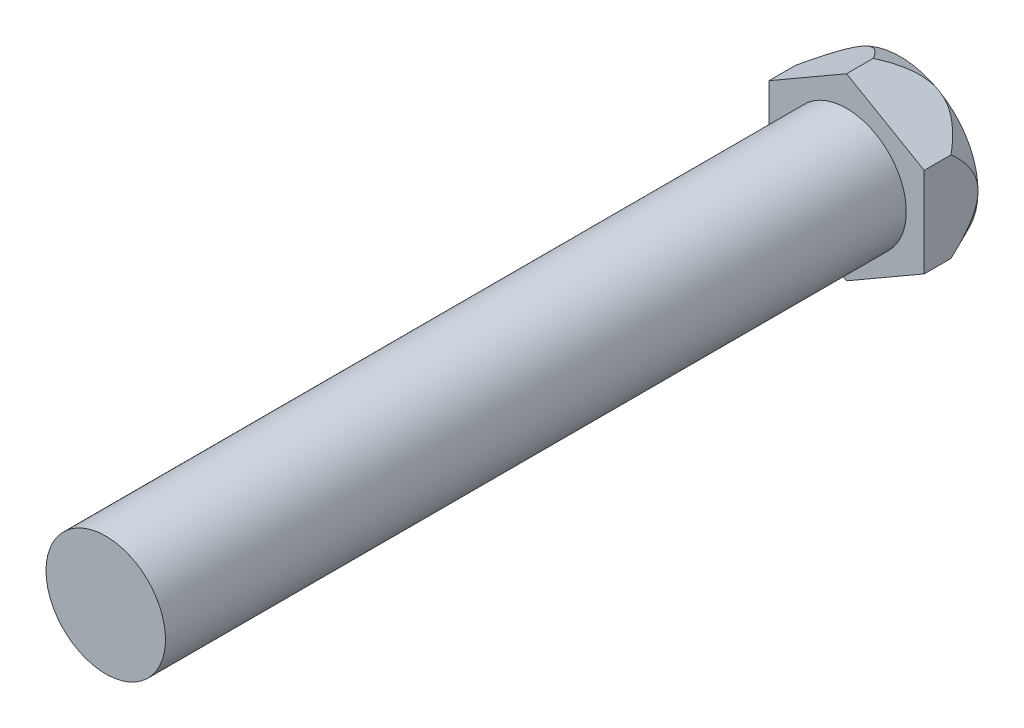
ISO-10303-21;
HEADER;
FILE_DESCRIPTION(('STEP AP214'),'2;1');
FILE_NAME('part.step','',(''),(''),'','','');
FILE_SCHEMA(('AUTOMOTIVE_DESIGN { 1 0 10303 214 1 1 1 1 }'));
ENDSEC;
DATA;
#1=APPLICATION_CONTEXT('core data for automotive mechanical design processes');
#2=APPLICATION_PROTOCOL_DEFINITION('international standard','automotive_design',2000,#1);
#3=PRODUCT_CONTEXT('',#1,'mechanical');
#4=PRODUCT('Part','Part','',(#3));
#5=PRODUCT_RELATED_PRODUCT_CATEGORY('part','',(#4));
#6=PRODUCT_DEFINITION_FORMATION('','',#4);
#7=PRODUCT_DEFINITION_CONTEXT('part definition',#1,'design');
#8=PRODUCT_DEFINITION('design','',#6,#7);
#9=PRODUCT_DEFINITION_SHAPE('','',#8);
#10=(LENGTH_UNIT() NAMED_UNIT(*) SI_UNIT(.MILLI.,.METRE.));
#11=(NAMED_UNIT(*) PLANE_ANGLE_UNIT() SI_UNIT($,.RADIAN.));
#12=(NAMED_UNIT(*) SI_UNIT($,.STERADIAN.) SOLID_ANGLE_UNIT());
#13=UNCERTAINTY_MEASURE_WITH_UNIT(LENGTH_MEASURE(1.E-05),#10,'distance_accuracy_value','');
#14=(GEOMETRIC_REPRESENTATION_CONTEXT(3) GLOBAL_UNCERTAINTY_ASSIGNED_CONTEXT((#13)) GLOBAL_UNIT_ASSIGNED_CONTEXT((#10,
#11,#12)) REPRESENTATION_CONTEXT('',''));
#15=CARTESIAN_POINT('',(0.,0.,0.));
#16=DIRECTION('',(0.,0.,1.));
#17=DIRECTION('',(1.,0.,0.));
#18=AXIS2_PLACEMENT_3D('',#15,#16,#17);
#19=CARTESIAN_POINT('',(0.,3.00222139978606,1.8));
#20=DIRECTION('',(0.,0.,1.));
#21=DIRECTION('',(1.,0.,0.));
#22=AXIS2_PLACEMENT_3D('',#19,#20,#21);
#23=PLANE('',#22);
#24=DIRECTION('',(-0.866025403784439,0.5,0.));
#25=VECTOR('',#24,1.);
#26=CARTESIAN_POINT('',(2.59999999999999,1.50111069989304,1.8));
#27=LINE('',#26,#25);
#28=CARTESIAN_POINT('',(2.59999999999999,1.50111069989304,1.8));
#29=VERTEX_POINT('',#28);
#30=CARTESIAN_POINT('',(0.,3.00222139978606,1.8));
#31=VERTEX_POINT('',#30);
#32=EDGE_CURVE('E233',#29,#31,#27,.T.);
#33=ORIENTED_EDGE('',*,*,#32,.T.);
#34=DIRECTION('',(-0.866025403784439,-0.499999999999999,0.));
#35=VECTOR('',#34,1.);
#36=CARTESIAN_POINT('',(0.,3.00222139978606,1.8));
#37=LINE('',#36,#35);
#38=CARTESIAN_POINT('',(-2.6,1.50111069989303,1.8));
#39=VERTEX_POINT('',#38);
#40=EDGE_CURVE('E232',#31,#39,#37,.T.);
#41=ORIENTED_EDGE('',*,*,#40,.T.);
#42=DIRECTION('',(0.,-1.,0.));
#43=VECTOR('',#42,1.);
#44=CARTESIAN_POINT('',(-2.6,1.50111069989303,1.8));
#45=LINE('',#44,#43);
#46=CARTESIAN_POINT('',(-2.60000000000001,-1.50111069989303,1.8));
#47=VERTEX_POINT('',#46);
#48=EDGE_CURVE('E228',#39,#47,#45,.T.);
#49=ORIENTED_EDGE('',*,*,#48,.T.);
#50=DIRECTION('',(0.866025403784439,-0.5,0.));
#51=VECTOR('',#50,1.);
#52=CARTESIAN_POINT('',(-2.60000000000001,-1.50111069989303,1.8));
#53=LINE('',#52,#51);
#54=CARTESIAN_POINT('',(0.,-3.00222139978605,1.8));
#55=VERTEX_POINT('',#54);
#56=EDGE_CURVE('E226',#47,#55,#53,.T.);
#57=ORIENTED_EDGE('',*,*,#56,.T.);
#58=DIRECTION('',(0.866025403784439,0.499999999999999,0.));
#59=VECTOR('',#58,1.);
#60=CARTESIAN_POINT('',(0.,-3.00222139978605,1.8));
#61=LINE('',#60,#59);
#62=CARTESIAN_POINT('',(2.59999999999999,-1.50111069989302,1.8));
#63=VERTEX_POINT('',#62);
#64=EDGE_CURVE('E224',#55,#63,#61,.T.);
#65=ORIENTED_EDGE('',*,*,#64,.T.);
#66=DIRECTION('',(0.,1.,0.));
#67=VECTOR('',#66,1.);
#68=CARTESIAN_POINT('',(2.59999999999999,-1.50111069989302,1.8));
#69=LINE('',#68,#67);
#70=EDGE_CURVE('E132',#63,#29,#69,.T.);
#71=ORIENTED_EDGE('',*,*,#70,.T.);
#72=EDGE_LOOP('',(#33,#41,#49,#57,#65,#71));
#73=FACE_BOUND('',#72,.T.);
#74=CARTESIAN_POINT('',(0.,0.,1.8));
#75=DIRECTION('',(0.,0.,1.));
#76=DIRECTION('',(1.,0.,0.));
#77=AXIS2_PLACEMENT_3D('',#74,#75,#76);
#78=CIRCLE('',#77,2.);
#79=CARTESIAN_POINT('',(-2.,0.,1.8));
#80=VERTEX_POINT('',#79);
#81=EDGE_CURVE('E246',#80,#80,#78,.T.);
#82=ORIENTED_EDGE('',*,*,#81,.F.);
#83=EDGE_LOOP('',(#82));
#84=FACE_BOUND('',#83,.T.);
#85=ADVANCED_FACE('F33',(#73,#84),#23,.T.);
#86=CARTESIAN_POINT('',(2.59999999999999,1.50111069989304,1.8));
#87=DIRECTION('',(-0.5,-0.866025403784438,0.));
#88=DIRECTION('',(0.866025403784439,-0.5,0.));
#89=AXIS2_PLACEMENT_3D('',#86,#87,#88);
#90=PLANE('',#89);
#91=CARTESIAN_POINT('',(-0.000199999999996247,3.0023368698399,0.903663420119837));
#92=CARTESIAN_POINT('',(0.0505418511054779,2.97304104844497,0.837965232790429));
#93=CARTESIAN_POINT('',(0.102480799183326,2.9430540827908,0.773392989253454));
#94=CARTESIAN_POINT('',(0.20979729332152,2.88109487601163,0.647258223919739));
#95=CARTESIAN_POINT('',(0.265197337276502,2.8491096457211,0.585721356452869));
#96=CARTESIAN_POINT('',(0.38178307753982,2.7817988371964,0.46532206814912));
#97=CARTESIAN_POINT('',(0.443104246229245,2.74639504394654,0.406631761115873));
#98=CARTESIAN_POINT('',(0.570477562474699,2.67285602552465,0.296879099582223));
#99=CARTESIAN_POINT('',(0.636513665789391,2.63473006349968,0.245792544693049));
#100=CARTESIAN_POINT('',(0.762562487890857,2.56195574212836,0.162330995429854));
#101=CARTESIAN_POINT('',(0.821712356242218,2.52780554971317,0.128253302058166));
#102=CARTESIAN_POINT('',(0.943392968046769,2.45755321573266,0.0707685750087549));
#103=CARTESIAN_POINT('',(1.00589571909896,2.42146723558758,0.0472850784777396));
#104=CARTESIAN_POINT('',(1.1345987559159,2.3471605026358,0.0133574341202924));
#105=CARTESIAN_POINT('',(1.20084027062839,2.30891594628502,0.00311287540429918));
#106=CARTESIAN_POINT('',(1.3338194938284,2.23214035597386,-0.00188356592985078));
#107=CARTESIAN_POINT('',(1.40055742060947,2.19360919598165,0.00337182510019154));
#108=CARTESIAN_POINT('',(1.52296787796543,2.12293548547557,0.0267089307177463));
#109=CARTESIAN_POINT('',(1.57891776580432,2.09063280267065,0.0429629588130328));
#110=CARTESIAN_POINT('',(1.68821868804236,2.02752788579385,0.0845012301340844));
#111=CARTESIAN_POINT('',(1.74156775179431,1.99672678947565,0.109792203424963));
#112=CARTESIAN_POINT('',(1.88849955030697,1.91189567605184,0.191333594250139));
#113=CARTESIAN_POINT('',(1.97860092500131,1.85987562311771,0.25582922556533));
#114=CARTESIAN_POINT('',(2.15021439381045,1.76079454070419,0.398848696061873));
#115=CARTESIAN_POINT('',(2.2316779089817,1.71376155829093,0.477445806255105));
#116=CARTESIAN_POINT('',(2.36101503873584,1.63908873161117,0.614723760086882));
#117=CARTESIAN_POINT('',(2.4108386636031,1.61032304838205,0.671008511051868));
#118=CARTESIAN_POINT('',(2.50748638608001,1.55452345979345,0.785780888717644));
#119=CARTESIAN_POINT('',(2.55433644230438,1.52747456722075,0.844239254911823));
#120=CARTESIAN_POINT('',(2.60019999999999,1.5009952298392,0.903663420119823));
#121=B_SPLINE_CURVE_WITH_KNOTS('',3,(#91,#92,#93,#94,#95,#96,#97,#98,#99,#100,#101,#102,#103,
#104,#105,#106,#107,#108,#109,#110,#111,#112,#113,#114,#115,#116,#117,#118,#119,#120),
.UNSPECIFIED.,.F.,.F.,(4,2,2,2,2,2,2,2,2,2,2,2,2,2,4),(0.,0.264191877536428,0.530328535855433,
0.80589864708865,1.08057203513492,1.30891430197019,1.53558107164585,1.76562664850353,
1.9957801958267,2.19485730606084,2.39408298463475,2.75917219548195,3.12621644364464,
3.36757528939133,3.60640522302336),.UNSPECIFIED.);
#122=CARTESIAN_POINT('',(0.,3.00222139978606,0.903404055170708));
#123=VERTEX_POINT('',#122);
#124=CARTESIAN_POINT('',(1.3,2.25166604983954,0.));
#125=VERTEX_POINT('',#124);
#126=EDGE_CURVE('E50',#123,#125,#121,.T.);
#127=ORIENTED_EDGE('',*,*,#126,.F.);
#128=DIRECTION('',(0.,0.,-1.));
#129=VECTOR('',#128,1.);
#130=CARTESIAN_POINT('',(0.,3.00222139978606,1.8));
#131=LINE('',#130,#129);
#132=EDGE_CURVE('E146',#31,#123,#131,.T.);
#133=ORIENTED_EDGE('',*,*,#132,.F.);
#134=ORIENTED_EDGE('',*,*,#32,.F.);
#135=DIRECTION('',(0.,0.,-1.));
#136=VECTOR('',#135,1.);
#137=CARTESIAN_POINT('',(2.59999999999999,1.50111069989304,1.8));
#138=LINE('',#137,#136);
#139=CARTESIAN_POINT('',(2.59999999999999,1.50111069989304,0.903404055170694));
#140=VERTEX_POINT('',#139);
#141=EDGE_CURVE('E134',#29,#140,#138,.T.);
#142=ORIENTED_EDGE('',*,*,#141,.T.);
#143=EDGE_CURVE('E128',#125,#140,#121,.T.);
#144=ORIENTED_EDGE('',*,*,#143,.F.);
#145=EDGE_LOOP('',(#127,#133,#134,#142,#144));
#146=FACE_BOUND('',#145,.T.);
#147=ADVANCED_FACE('F35',(#146),#90,.F.);
#148=CARTESIAN_POINT('',(0.,3.00222139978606,1.8));
#149=DIRECTION('',(0.499999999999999,-0.866025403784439,0.));
#150=DIRECTION('',(0.866025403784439,0.499999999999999,0.));
#151=AXIS2_PLACEMENT_3D('',#148,#149,#150);
#152=PLANE('',#151);
#153=CARTESIAN_POINT('',(-2.60020000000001,1.50099522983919,0.90366342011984));
#154=CARTESIAN_POINT('',(-2.54945814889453,1.53029105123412,0.837965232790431));
#155=CARTESIAN_POINT('',(-2.49751920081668,1.56027801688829,0.773392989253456));
#156=CARTESIAN_POINT('',(-2.39020270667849,1.62223722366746,0.647258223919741));
#157=CARTESIAN_POINT('',(-2.33480266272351,1.65422245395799,0.585721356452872));
#158=CARTESIAN_POINT('',(-2.21821692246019,1.72153326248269,0.465322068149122));
#159=CARTESIAN_POINT('',(-2.15689575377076,1.75693705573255,0.406631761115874));
#160=CARTESIAN_POINT('',(-2.02952243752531,1.83047607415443,0.296879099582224));
#161=CARTESIAN_POINT('',(-1.96348633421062,1.86860203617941,0.24579254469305));
#162=CARTESIAN_POINT('',(-1.83743751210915,1.94137635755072,0.162330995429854));
#163=CARTESIAN_POINT('',(-1.77828764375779,1.97552654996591,0.128253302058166));
#164=CARTESIAN_POINT('',(-1.65660703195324,2.04577888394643,0.070768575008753));
#165=CARTESIAN_POINT('',(-1.59410428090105,2.0818648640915,0.0472850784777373));
#166=CARTESIAN_POINT('',(-1.46540124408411,2.15617159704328,0.013357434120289));
#167=CARTESIAN_POINT('',(-1.39915972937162,2.19441615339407,0.00311287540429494));
#168=CARTESIAN_POINT('',(-1.26618050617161,2.27119174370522,-0.00188356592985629));
#169=CARTESIAN_POINT('',(-1.19944257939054,2.30972290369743,0.00337182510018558));
#170=CARTESIAN_POINT('',(-1.07703212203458,2.38039661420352,0.0267089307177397));
#171=CARTESIAN_POINT('',(-1.02108223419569,2.41269929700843,0.0429629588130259));
#172=CARTESIAN_POINT('',(-0.911781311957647,2.47580421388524,0.0845012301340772));
#173=CARTESIAN_POINT('',(-0.8584322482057,2.50660531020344,0.109792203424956));
#174=CARTESIAN_POINT('',(-0.711500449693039,2.59143642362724,0.191333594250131));
#175=CARTESIAN_POINT('',(-0.621399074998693,2.64345647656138,0.25582922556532));
#176=CARTESIAN_POINT('',(-0.449785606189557,2.7425375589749,0.398848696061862));
#177=CARTESIAN_POINT('',(-0.368322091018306,2.78957054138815,0.477445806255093));
#178=CARTESIAN_POINT('',(-0.238984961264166,2.86424336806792,0.614723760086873));
#179=CARTESIAN_POINT('',(-0.189161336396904,2.89300905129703,0.671008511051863));
#180=CARTESIAN_POINT('',(-0.0925136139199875,2.94880863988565,0.785780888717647));
#181=CARTESIAN_POINT('',(-0.045663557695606,2.97585753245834,0.844239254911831));
#182=CARTESIAN_POINT('',(0.000200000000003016,3.0023368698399,0.903663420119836));
#183=B_SPLINE_CURVE_WITH_KNOTS('',3,(#153,#154,#155,#156,#157,#158,#159,#160,#161,#162,#163,
#164,#165,#166,#167,#168,#169,#170,#171,#172,#173,#174,#175,#176,#177,#178,#179,#180,#181,#182),
.UNSPECIFIED.,.F.,.F.,(4,2,2,2,2,2,2,2,2,2,2,2,2,2,4),(0.,0.264191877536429,0.530328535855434,
0.80589864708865,1.08057203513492,1.30891430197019,1.53558107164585,1.76562664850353,
1.9957801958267,2.19485730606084,2.39408298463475,2.75917219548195,3.12621644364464,
3.36757528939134,3.60640522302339),.UNSPECIFIED.);
#184=CARTESIAN_POINT('',(-2.60000000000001,1.50111069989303,0.903404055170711));
#185=VERTEX_POINT('',#184);
#186=CARTESIAN_POINT('',(-1.3,2.25166604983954,0.));
#187=VERTEX_POINT('',#186);
#188=EDGE_CURVE('E57',#185,#187,#183,.T.);
#189=ORIENTED_EDGE('',*,*,#188,.F.);
#190=DIRECTION('',(0.,0.,-1.));
#191=VECTOR('',#190,1.);
#192=CARTESIAN_POINT('',(-2.6,1.50111069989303,1.8));
#193=LINE('',#192,#191);
#194=EDGE_CURVE('E144',#39,#185,#193,.T.);
#195=ORIENTED_EDGE('',*,*,#194,.F.);
#196=ORIENTED_EDGE('',*,*,#40,.F.);
#197=ORIENTED_EDGE('',*,*,#132,.T.);
#198=EDGE_CURVE('E161',#187,#123,#183,.T.);
#199=ORIENTED_EDGE('',*,*,#198,.F.);
#200=EDGE_LOOP('',(#189,#195,#196,#197,#199));
#201=FACE_BOUND('',#200,.T.);
#202=ADVANCED_FACE('F168',(#201),#152,.F.);
#203=CARTESIAN_POINT('',(-2.6,1.50111069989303,1.8));
#204=DIRECTION('',(1.,0.,0.));
#205=DIRECTION('',(0.,1.,0.));
#206=AXIS2_PLACEMENT_3D('',#203,#204,#205);
#207=PLANE('',#206);
#208=CARTESIAN_POINT('',(-2.60000000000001,-5.77730727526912,8.38984331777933));
#209=CARTESIAN_POINT('',(-2.60000000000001,-5.64240521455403,8.11358700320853));
#210=CARTESIAN_POINT('',(-2.60000000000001,-5.50689534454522,7.8376246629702));
#211=CARTESIAN_POINT('',(-2.60000000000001,-5.23426410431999,7.28644828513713));
#212=CARTESIAN_POINT('',(-2.60000000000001,-5.09714250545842,7.01123436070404));
#213=CARTESIAN_POINT('',(-2.60000000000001,-4.82012461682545,6.46019165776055));
#214=CARTESIAN_POINT('',(-2.60000000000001,-4.68021680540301,6.18436866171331));
#215=CARTESIAN_POINT('',(-2.60000000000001,-4.39785834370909,5.63406262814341));
#216=CARTESIAN_POINT('',(-2.60000000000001,-4.25540797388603,5.35957944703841));
#217=CARTESIAN_POINT('',(-2.60000000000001,-3.9533318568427,4.78614586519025));
#218=CARTESIAN_POINT('',(-2.60000000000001,-3.79336883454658,4.48737274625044));
#219=CARTESIAN_POINT('',(-2.60000000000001,-3.4677725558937,3.89276816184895));
#220=CARTESIAN_POINT('',(-2.60000000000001,-3.30213732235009,3.59693776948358));
#221=CARTESIAN_POINT('',(-2.60000000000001,-3.04768601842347,3.15721872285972));
#222=CARTESIAN_POINT('',(-2.60000000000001,-2.96199630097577,3.01152280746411));
#223=CARTESIAN_POINT('',(-2.60000000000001,-2.78801980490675,2.72169305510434));
#224=CARTESIAN_POINT('',(-2.60000000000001,-2.69973315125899,2.57755914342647));
#225=CARTESIAN_POINT('',(-2.60000000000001,-2.51991708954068,2.29144080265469));
#226=CARTESIAN_POINT('',(-2.60000000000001,-2.42838961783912,2.14945516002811));
#227=CARTESIAN_POINT('',(-2.60000000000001,-2.24106774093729,1.86833682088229));
#228=CARTESIAN_POINT('',(-2.60000000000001,-2.14527418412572,1.72920356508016));
#229=CARTESIAN_POINT('',(-2.60000000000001,-2.01089983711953,1.54253893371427));
#230=CARTESIAN_POINT('',(-2.60000000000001,-1.97481631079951,1.49320792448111));
#231=CARTESIAN_POINT('',(-2.60000000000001,-1.9017946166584,1.39518087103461));
#232=CARTESIAN_POINT('',(-2.60000000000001,-1.86485642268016,1.34648484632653));
#233=CARTESIAN_POINT('',(-2.60000000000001,-1.75256199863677,1.20144386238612));
#234=CARTESIAN_POINT('',(-2.60000000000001,-1.67576470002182,1.10620038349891));
#235=CARTESIAN_POINT('',(-2.60000000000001,-1.51778109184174,0.920521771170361));
#236=CARTESIAN_POINT('',(-2.60000000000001,-1.4366286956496,0.830058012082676));
#237=CARTESIAN_POINT('',(-2.60000000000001,-1.26800254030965,0.655282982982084));
#238=CARTESIAN_POINT('',(-2.60000000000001,-1.18053575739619,0.570965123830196));
#239=CARTESIAN_POINT('',(-2.60000000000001,-1.00984038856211,0.422867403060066));
#240=CARTESIAN_POINT('',(-2.60000000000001,-0.927693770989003,0.357859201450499));
#241=CARTESIAN_POINT('',(-2.60000000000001,-0.755692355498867,0.238894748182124));
#242=CARTESIAN_POINT('',(-2.60000000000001,-0.665854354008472,0.184915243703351));
#243=CARTESIAN_POINT('',(-2.60000000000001,-0.505584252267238,0.107619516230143));
#244=CARTESIAN_POINT('',(-2.60000000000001,-0.43729009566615,0.0799568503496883));
#245=CARTESIAN_POINT('',(-2.60000000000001,-0.297119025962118,0.0359502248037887));
#246=CARTESIAN_POINT('',(-2.60000000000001,-0.225247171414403,0.0195907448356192));
#247=CARTESIAN_POINT('',(-2.60000000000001,-0.0790064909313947,0.000384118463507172));
#248=CARTESIAN_POINT('',(-2.60000000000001,-0.00462144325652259,-0.00234491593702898));
#249=CARTESIAN_POINT('',(-2.60000000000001,0.143258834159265,0.0064950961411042));
#250=CARTESIAN_POINT('',(-2.60000000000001,0.216753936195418,0.0180661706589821));
#251=CARTESIAN_POINT('',(-2.60000000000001,0.372009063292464,0.0565290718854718));
#252=CARTESIAN_POINT('',(-2.60000000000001,0.45321998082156,0.085568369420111));
#253=CARTESIAN_POINT('',(-2.60000000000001,0.61006290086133,0.156095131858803));
#254=CARTESIAN_POINT('',(-2.60000000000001,0.685678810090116,0.197616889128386));
#255=CARTESIAN_POINT('',(-2.60000000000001,0.826347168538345,0.286105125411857));
#256=CARTESIAN_POINT('',(-2.60000000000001,0.891768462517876,0.332500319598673));
#257=CARTESIAN_POINT('',(-2.60000000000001,1.01850015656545,0.430650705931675));
#258=CARTESIAN_POINT('',(-2.60000000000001,1.07980646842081,0.482411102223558));
#259=CARTESIAN_POINT('',(-2.60000000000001,1.19943543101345,0.590256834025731));
#260=CARTESIAN_POINT('',(-2.6,1.25772690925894,0.646376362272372));
#261=CARTESIAN_POINT('',(-2.6,1.37131070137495,0.761485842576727));
#262=CARTESIAN_POINT('',(-2.6,1.42660471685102,0.820474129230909));
#263=CARTESIAN_POINT('',(-2.6,1.54103150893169,0.947656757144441));
#264=CARTESIAN_POINT('',(-2.6,1.59986073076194,1.01612284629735));
#265=CARTESIAN_POINT('',(-2.6,1.71500358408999,1.15514576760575));
#266=CARTESIAN_POINT('',(-2.6,1.77131675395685,1.22570297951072));
#267=CARTESIAN_POINT('',(-2.6,1.93722002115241,1.43988083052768));
#268=CARTESIAN_POINT('',(-2.6,2.04369183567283,1.58591360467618));
#269=CARTESIAN_POINT('',(-2.6,2.25114405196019,1.88264649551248));
#270=CARTESIAN_POINT('',(-2.6,2.35210047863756,2.0333631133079));
#271=CARTESIAN_POINT('',(-2.6,2.54956621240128,2.33758479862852));
#272=CARTESIAN_POINT('',(-2.6,2.64607729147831,2.49108872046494));
#273=CARTESIAN_POINT('',(-2.6,2.8270189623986,2.78594404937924));
#274=CARTESIAN_POINT('',(-2.6,2.91174452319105,2.9271154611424));
#275=CARTESIAN_POINT('',(-2.6,3.07898326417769,3.21078355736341));
#276=CARTESIAN_POINT('',(-2.6,3.16149617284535,3.35328040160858));
#277=CARTESIAN_POINT('',(-2.6,3.32400942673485,3.63806654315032));
#278=CARTESIAN_POINT('',(-2.6,3.40402532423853,3.78034698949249));
#279=CARTESIAN_POINT('',(-2.6,3.56255529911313,4.06570493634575));
#280=CARTESIAN_POINT('',(-2.6,3.64106967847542,4.20878226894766));
#281=CARTESIAN_POINT('',(-2.6,3.71898661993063,4.3521801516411));
#282=B_SPLINE_CURVE_WITH_KNOTS('',3,(#208,#209,#210,#211,#212,#213,#214,#215,#216,#217,#218,
#219,#220,#221,#222,#223,#224,#225,#226,#227,#228,#229,#230,#231,#232,#233,#234,#235,#236,#237,
#238,#239,#240,#241,#242,#243,#244,#245,#246,#247,#248,#249,#250,#251,#252,#253,#254,#255,#256,
#257,#258,#259,#260,#261,#262,#263,#264,#265,#266,#267,#268,#269,#270,#271,#272,#273,#274,#275,
#276,#277,#278,#279,#280,#281),.UNSPECIFIED.,.F.,.F.,(4,2,2,2,2,2,2,2,2,2,2,2,2,2,2,2,2,2,2,2,2,
2,2,2,2,2,2,2,2,2,2,2,2,2,2,2,4),(0.,0.922307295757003,1.84474705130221,2.77256919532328,
3.70028962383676,4.71695599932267,5.73398043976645,6.2410408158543,6.74807683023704,
7.25481484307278,7.76145252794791,7.94480226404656,8.12815761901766,8.49506859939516,
8.85944972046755,9.22343425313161,9.53716840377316,9.85023409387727,10.0705319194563,
10.2905266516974,10.5124244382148,10.7343536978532,10.9916459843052,11.2496516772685,
11.4899031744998,11.7303899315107,11.9730029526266,12.215476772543,12.4862070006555,
12.7569866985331,13.2989199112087,13.8430469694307,14.3869552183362,14.8808655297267,
15.3748361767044,15.8645374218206,16.3541391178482),.UNSPECIFIED.);
#283=CARTESIAN_POINT('',(-2.60000000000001,-1.50111069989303,0.90340405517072));
#284=VERTEX_POINT('',#283);
#285=CARTESIAN_POINT('',(-2.6,0.,0.));
#286=VERTEX_POINT('',#285);
#287=EDGE_CURVE('E235',#284,#286,#282,.T.);
#288=ORIENTED_EDGE('',*,*,#287,.F.);
#289=DIRECTION('',(0.,0.,-1.));
#290=VECTOR('',#289,1.);
#291=CARTESIAN_POINT('',(-2.60000000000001,-1.50111069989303,1.8));
#292=LINE('',#291,#290);
#293=EDGE_CURVE('E136',#47,#284,#292,.T.);
#294=ORIENTED_EDGE('',*,*,#293,.F.);
#295=ORIENTED_EDGE('',*,*,#48,.F.);
#296=ORIENTED_EDGE('',*,*,#194,.T.);
#297=EDGE_CURVE('E184',#286,#185,#282,.T.);
#298=ORIENTED_EDGE('',*,*,#297,.F.);
#299=EDGE_LOOP('',(#288,#294,#295,#296,#298));
#300=FACE_BOUND('',#299,.T.);
#301=ADVANCED_FACE('F240',(#300),#207,.F.);
#302=CARTESIAN_POINT('',(-2.60000000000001,-1.50111069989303,1.8));
#303=DIRECTION('',(0.5,0.866025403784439,0.));
#304=DIRECTION('',(-0.866025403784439,0.5,0.));
#305=AXIS2_PLACEMENT_3D('',#302,#303,#304);
#306=PLANE('',#305);
#307=CARTESIAN_POINT('',(0.000199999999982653,-3.00233686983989,0.90366342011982));
#308=CARTESIAN_POINT('',(-0.0505418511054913,-2.97304104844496,0.837965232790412));
#309=CARTESIAN_POINT('',(-0.10248079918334,-2.94305408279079,0.773392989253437));
#310=CARTESIAN_POINT('',(-0.209797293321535,-2.88109487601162,0.647258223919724));
#311=CARTESIAN_POINT('',(-0.265197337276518,-2.84910964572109,0.585721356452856));
#312=CARTESIAN_POINT('',(-0.381783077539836,-2.78179883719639,0.465322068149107));
#313=CARTESIAN_POINT('',(-0.443104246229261,-2.74639504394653,0.40663176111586));
#314=CARTESIAN_POINT('',(-0.570477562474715,-2.67285602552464,0.296879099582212));
#315=CARTESIAN_POINT('',(-0.636513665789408,-2.63473006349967,0.245792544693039));
#316=CARTESIAN_POINT('',(-0.762562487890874,-2.56195574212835,0.162330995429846));
#317=CARTESIAN_POINT('',(-0.821712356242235,-2.52780554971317,0.12825330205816));
#318=CARTESIAN_POINT('',(-0.943392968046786,-2.45755321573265,0.0707685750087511));
#319=CARTESIAN_POINT('',(-1.00589571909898,-2.42146723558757,0.0472850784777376));
#320=CARTESIAN_POINT('',(-1.13459875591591,-2.3471605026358,0.013357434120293));
#321=CARTESIAN_POINT('',(-1.2008402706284,-2.30891594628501,0.00311287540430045));
#322=CARTESIAN_POINT('',(-1.33381949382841,-2.23214035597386,-0.00188356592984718));
#323=CARTESIAN_POINT('',(-1.40055742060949,-2.19360919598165,0.00337182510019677));
#324=CARTESIAN_POINT('',(-1.52296787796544,-2.12293548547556,0.0267089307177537));
#325=CARTESIAN_POINT('',(-1.57891776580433,-2.09063280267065,0.042962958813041));
#326=CARTESIAN_POINT('',(-1.68821868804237,-2.02752788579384,0.0845012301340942));
#327=CARTESIAN_POINT('',(-1.74156775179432,-1.99672678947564,0.109792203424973));
#328=CARTESIAN_POINT('',(-1.88849955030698,-1.91189567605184,0.191333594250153));
#329=CARTESIAN_POINT('',(-1.97860092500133,-1.8598756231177,0.255829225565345));
#330=CARTESIAN_POINT('',(-2.15021439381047,-1.76079454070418,0.398848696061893));
#331=CARTESIAN_POINT('',(-2.23167790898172,-1.71376155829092,0.477445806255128));
#332=CARTESIAN_POINT('',(-2.36101503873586,-1.63908873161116,0.614723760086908));
#333=CARTESIAN_POINT('',(-2.41083866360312,-1.61032304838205,0.671008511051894));
#334=CARTESIAN_POINT('',(-2.50748638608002,-1.55452345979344,0.78578088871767));
#335=CARTESIAN_POINT('',(-2.5543364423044,-1.52747456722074,0.844239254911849));
#336=CARTESIAN_POINT('',(-2.60020000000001,-1.50099522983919,0.903663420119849));
#337=B_SPLINE_CURVE_WITH_KNOTS('',3,(#307,#308,#309,#310,#311,#312,#313,#314,#315,#316,#317,
#318,#319,#320,#321,#322,#323,#324,#325,#326,#327,#328,#329,#330,#331,#332,#333,#334,#335,#336),
.UNSPECIFIED.,.F.,.F.,(4,2,2,2,2,2,2,2,2,2,2,2,2,2,4),(0.,0.264191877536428,0.530328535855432,
0.805898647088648,1.08057203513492,1.30891430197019,1.53558107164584,1.76562664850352,
1.99578019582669,2.19485730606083,2.39408298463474,2.75917219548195,3.12621644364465,
3.36757528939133,3.60640522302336),.UNSPECIFIED.);
#338=CARTESIAN_POINT('',(0.,-3.00222139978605,0.903404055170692));
#339=VERTEX_POINT('',#338);
#340=CARTESIAN_POINT('',(-1.3,-2.25166604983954,0.));
#341=VERTEX_POINT('',#340);
#342=EDGE_CURVE('E170',#339,#341,#337,.T.);
#343=ORIENTED_EDGE('',*,*,#342,.F.);
#344=DIRECTION('',(0.,0.,-1.));
#345=VECTOR('',#344,1.);
#346=CARTESIAN_POINT('',(0.,-3.00222139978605,1.8));
#347=LINE('',#346,#345);
#348=EDGE_CURVE('E133',#55,#339,#347,.T.);
#349=ORIENTED_EDGE('',*,*,#348,.F.);
#350=ORIENTED_EDGE('',*,*,#56,.F.);
#351=ORIENTED_EDGE('',*,*,#293,.T.);
#352=EDGE_CURVE('E172',#341,#284,#337,.T.);
#353=ORIENTED_EDGE('',*,*,#352,.F.);
#354=EDGE_LOOP('',(#343,#349,#350,#351,#353));
#355=FACE_BOUND('',#354,.T.);
#356=ADVANCED_FACE('F222',(#355),#306,.F.);
#357=CARTESIAN_POINT('',(0.,-3.00222139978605,1.8));
#358=DIRECTION('',(-0.499999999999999,0.866025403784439,0.));
#359=DIRECTION('',(-0.866025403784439,-0.499999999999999,0.));
#360=AXIS2_PLACEMENT_3D('',#357,#358,#359);
#361=PLANE('',#360);
#362=CARTESIAN_POINT('',(2.60019999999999,-1.50099522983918,0.903663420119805));
#363=CARTESIAN_POINT('',(2.54945814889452,-1.53029105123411,0.837965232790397));
#364=CARTESIAN_POINT('',(2.49751920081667,-1.56027801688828,0.773392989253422));
#365=CARTESIAN_POINT('',(2.39020270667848,-1.62223722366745,0.647258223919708));
#366=CARTESIAN_POINT('',(2.33480266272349,-1.65422245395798,0.585721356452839));
#367=CARTESIAN_POINT('',(2.21821692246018,-1.72153326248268,0.465322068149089));
#368=CARTESIAN_POINT('',(2.15689575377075,-1.75693705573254,0.406631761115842));
#369=CARTESIAN_POINT('',(2.0295224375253,-1.83047607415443,0.296879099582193));
#370=CARTESIAN_POINT('',(1.96348633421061,-1.8686020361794,0.245792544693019));
#371=CARTESIAN_POINT('',(1.83743751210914,-1.94137635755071,0.162330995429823));
#372=CARTESIAN_POINT('',(1.77828764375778,-1.9755265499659,0.128253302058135));
#373=CARTESIAN_POINT('',(1.65660703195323,-2.04577888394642,0.0707685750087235));
#374=CARTESIAN_POINT('',(1.59410428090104,-2.08186486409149,0.0472850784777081));
#375=CARTESIAN_POINT('',(1.46540124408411,-2.15617159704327,0.0133574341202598));
#376=CARTESIAN_POINT('',(1.39915972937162,-2.19441615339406,0.00311287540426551));
#377=CARTESIAN_POINT('',(1.2661805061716,-2.27119174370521,-0.00188356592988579));
#378=CARTESIAN_POINT('',(1.19944257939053,-2.30972290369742,0.00337182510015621));
#379=CARTESIAN_POINT('',(1.07703212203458,-2.38039661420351,0.026708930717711));
#380=CARTESIAN_POINT('',(1.02108223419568,-2.41269929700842,0.0429629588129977));
#381=CARTESIAN_POINT('',(0.911781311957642,-2.47580421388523,0.0845012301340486));
#382=CARTESIAN_POINT('',(0.858432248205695,-2.50660531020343,0.109792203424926));
#383=CARTESIAN_POINT('',(0.711500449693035,-2.59143642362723,0.1913335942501));
#384=CARTESIAN_POINT('',(0.62139907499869,-2.64345647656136,0.25582922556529));
#385=CARTESIAN_POINT('',(0.449785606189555,-2.74253755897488,0.398848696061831));
#386=CARTESIAN_POINT('',(0.368322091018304,-2.78957054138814,0.477445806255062));
#387=CARTESIAN_POINT('',(0.238984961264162,-2.86424336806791,0.614723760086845));
#388=CARTESIAN_POINT('',(0.189161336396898,-2.89300905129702,0.671008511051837));
#389=CARTESIAN_POINT('',(0.0925136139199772,-2.94880863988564,0.785780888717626));
#390=CARTESIAN_POINT('',(0.0456635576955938,-2.97585753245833,0.844239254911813));
#391=CARTESIAN_POINT('',(-0.000200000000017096,-3.00233686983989,0.903663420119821));
#392=B_SPLINE_CURVE_WITH_KNOTS('',3,(#362,#363,#364,#365,#366,#367,#368,#369,#370,#371,#372,
#373,#374,#375,#376,#377,#378,#379,#380,#381,#382,#383,#384,#385,#386,#387,#388,#389,#390,#391),
.UNSPECIFIED.,.F.,.F.,(4,2,2,2,2,2,2,2,2,2,2,2,2,2,4),(0.,0.264191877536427,0.530328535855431,
0.805898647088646,1.08057203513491,1.30891430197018,1.53558107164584,1.76562664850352,
1.99578019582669,2.19485730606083,2.39408298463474,2.75917219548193,3.12621644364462,
3.36757528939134,3.6064052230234),.UNSPECIFIED.);
#393=CARTESIAN_POINT('',(2.59999999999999,-1.50111069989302,0.903404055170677));
#394=VERTEX_POINT('',#393);
#395=CARTESIAN_POINT('',(1.3,-2.25166604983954,0.));
#396=VERTEX_POINT('',#395);
#397=EDGE_CURVE('E110',#394,#396,#392,.T.);
#398=ORIENTED_EDGE('',*,*,#397,.F.);
#399=DIRECTION('',(0.,0.,-1.));
#400=VECTOR('',#399,1.);
#401=CARTESIAN_POINT('',(2.59999999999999,-1.50111069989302,1.8));
#402=LINE('',#401,#400);
#403=EDGE_CURVE('E124',#63,#394,#402,.T.);
#404=ORIENTED_EDGE('',*,*,#403,.F.);
#405=ORIENTED_EDGE('',*,*,#64,.F.);
#406=ORIENTED_EDGE('',*,*,#348,.T.);
#407=EDGE_CURVE('E127',#396,#339,#392,.T.);
#408=ORIENTED_EDGE('',*,*,#407,.F.);
#409=EDGE_LOOP('',(#398,#404,#405,#406,#408));
#410=FACE_BOUND('',#409,.T.);
#411=ADVANCED_FACE('F122',(#410),#361,.F.);
#412=CARTESIAN_POINT('',(2.59999999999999,-1.50111069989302,1.8));
#413=DIRECTION('',(-1.,0.,0.));
#414=DIRECTION('',(0.,0.,1.));
#415=AXIS2_PLACEMENT_3D('',#412,#413,#414);
#416=PLANE('',#415);
#417=CARTESIAN_POINT('',(2.59999999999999,-5.77730727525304,8.38984331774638));
#418=CARTESIAN_POINT('',(2.59999999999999,-5.64240521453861,8.11358700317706));
#419=CARTESIAN_POINT('',(2.59999999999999,-5.50689534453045,7.83762466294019));
#420=CARTESIAN_POINT('',(2.59999999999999,-5.23426410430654,7.28644828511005));
#421=CARTESIAN_POINT('',(2.59999999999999,-5.09714250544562,7.01123436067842));
#422=CARTESIAN_POINT('',(2.59999999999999,-4.82012461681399,6.46019165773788));
#423=CARTESIAN_POINT('',(2.59999999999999,-4.68021680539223,6.18436866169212));
#424=CARTESIAN_POINT('',(2.59999999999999,-4.39785834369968,5.6340626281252));
#425=CARTESIAN_POINT('',(2.59999999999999,-4.2554079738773,5.35957944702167));
#426=CARTESIAN_POINT('',(2.59999999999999,-3.95333185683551,4.78614586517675));
#427=CARTESIAN_POINT('',(2.59999999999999,-3.79336883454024,4.48737274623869));
#428=CARTESIAN_POINT('',(2.59999999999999,-3.46777255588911,3.8927681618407));
#429=CARTESIAN_POINT('',(2.59999999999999,-3.3021373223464,3.59693776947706));
#430=CARTESIAN_POINT('',(2.59999999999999,-3.04768601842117,3.15721872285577));
#431=CARTESIAN_POINT('',(2.59999999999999,-2.96199630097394,3.011522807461));
#432=CARTESIAN_POINT('',(2.59999999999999,-2.78801980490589,2.72169305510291));
#433=CARTESIAN_POINT('',(2.59999999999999,-2.69973315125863,2.57755914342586));
#434=CARTESIAN_POINT('',(2.59999999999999,-2.51991708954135,2.29144080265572));
#435=CARTESIAN_POINT('',(2.59999999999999,-2.42838961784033,2.14945516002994));
#436=CARTESIAN_POINT('',(2.59999999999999,-2.24106774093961,1.86833682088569));
#437=CARTESIAN_POINT('',(2.59999999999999,-2.14527418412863,1.72920356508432));
#438=CARTESIAN_POINT('',(2.59999999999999,-2.01089983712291,1.54253893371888));
#439=CARTESIAN_POINT('',(2.59999999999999,-1.97481631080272,1.49320792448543));
#440=CARTESIAN_POINT('',(2.59999999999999,-1.90179461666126,1.39518087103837));
#441=CARTESIAN_POINT('',(2.59999999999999,-1.86485642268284,1.34648484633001));
#442=CARTESIAN_POINT('',(2.59999999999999,-1.7525619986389,1.20144386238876));
#443=CARTESIAN_POINT('',(2.59999999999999,-1.67576470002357,1.106200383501));
#444=CARTESIAN_POINT('',(2.59999999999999,-1.51778109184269,0.920521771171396));
#445=CARTESIAN_POINT('',(2.59999999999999,-1.43662869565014,0.830058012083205));
#446=CARTESIAN_POINT('',(2.59999999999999,-1.26800254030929,0.655282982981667));
#447=CARTESIAN_POINT('',(2.59999999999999,-1.18053575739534,0.570965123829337));
#448=CARTESIAN_POINT('',(2.59999999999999,-1.00984038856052,0.422867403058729));
#449=CARTESIAN_POINT('',(2.59999999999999,-0.927693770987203,0.357859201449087));
#450=CARTESIAN_POINT('',(2.59999999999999,-0.755692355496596,0.238894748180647));
#451=CARTESIAN_POINT('',(2.59999999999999,-0.665854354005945,0.184915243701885));
#452=CARTESIAN_POINT('',(2.59999999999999,-0.505584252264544,0.107619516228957));
#453=CARTESIAN_POINT('',(2.59999999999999,-0.437290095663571,0.0799568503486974));
#454=CARTESIAN_POINT('',(2.59999999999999,-0.297119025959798,0.035950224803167));
#455=CARTESIAN_POINT('',(2.59999999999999,-0.225247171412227,0.0195907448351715));
#456=CARTESIAN_POINT('',(2.59999999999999,-0.079006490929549,0.000384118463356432));
#457=CARTESIAN_POINT('',(2.59999999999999,-0.00462144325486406,-0.00234491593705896));
#458=CARTESIAN_POINT('',(2.59999999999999,0.143258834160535,0.00649509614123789));
#459=CARTESIAN_POINT('',(2.59999999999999,0.216753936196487,0.0180661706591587));
#460=CARTESIAN_POINT('',(2.59999999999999,0.372009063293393,0.0565290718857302));
#461=CARTESIAN_POINT('',(2.59999999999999,0.453219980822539,0.0855683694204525));
#462=CARTESIAN_POINT('',(2.59999999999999,0.610062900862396,0.156095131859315));
#463=CARTESIAN_POINT('',(2.59999999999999,0.685678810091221,0.197616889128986));
#464=CARTESIAN_POINT('',(2.59999999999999,0.826347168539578,0.286105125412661));
#465=CARTESIAN_POINT('',(2.59999999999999,0.891768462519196,0.332500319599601));
#466=CARTESIAN_POINT('',(2.59999999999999,1.01850015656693,0.430650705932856));
#467=CARTESIAN_POINT('',(2.59999999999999,1.07980646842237,0.482411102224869));
#468=CARTESIAN_POINT('',(2.59999999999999,1.19943543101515,0.590256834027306));
#469=CARTESIAN_POINT('',(2.59999999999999,1.25772690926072,0.646376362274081));
#470=CARTESIAN_POINT('',(2.59999999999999,1.37131070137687,0.761485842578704));
#471=CARTESIAN_POINT('',(2.59999999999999,1.426604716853,0.820474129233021));
#472=CARTESIAN_POINT('',(2.59999999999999,1.5410315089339,0.947656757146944));
#473=CARTESIAN_POINT('',(2.59999999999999,1.59986073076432,1.01612284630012));
#474=CARTESIAN_POINT('',(2.59999999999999,1.71500358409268,1.15514576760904));
#475=CARTESIAN_POINT('',(2.59999999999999,1.77131675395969,1.22570297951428));
#476=CARTESIAN_POINT('',(2.59999999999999,1.93722002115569,1.43988083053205));
#477=CARTESIAN_POINT('',(2.59999999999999,2.04369183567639,1.58591360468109));
#478=CARTESIAN_POINT('',(2.59999999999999,2.2511440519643,1.8826464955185));
#479=CARTESIAN_POINT('',(2.59999999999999,2.35210047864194,2.03336311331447));
#480=CARTESIAN_POINT('',(2.59999999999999,2.54956621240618,2.33758479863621));
#481=CARTESIAN_POINT('',(2.59999999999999,2.64607729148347,2.49108872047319));
#482=CARTESIAN_POINT('',(2.59999999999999,2.82701896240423,2.78594404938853));
#483=CARTESIAN_POINT('',(2.59999999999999,2.9117445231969,2.92711546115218));
#484=CARTESIAN_POINT('',(2.59999999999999,3.07898326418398,3.21078355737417));
#485=CARTESIAN_POINT('',(2.59999999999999,3.16149617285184,3.35328040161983));
#486=CARTESIAN_POINT('',(2.59999999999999,3.32400942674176,3.63806654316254));
#487=CARTESIAN_POINT('',(2.59999999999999,3.40402532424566,3.7803469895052));
#488=CARTESIAN_POINT('',(2.59999999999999,3.56255529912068,4.06570493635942));
#489=CARTESIAN_POINT('',(2.59999999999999,3.64106967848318,4.20878226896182));
#490=CARTESIAN_POINT('',(2.59999999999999,3.7189866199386,4.35218015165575));
#491=B_SPLINE_CURVE_WITH_KNOTS('',3,(#417,#418,#419,#420,#421,#422,#423,#424,#425,#426,#427,
#428,#429,#430,#431,#432,#433,#434,#435,#436,#437,#438,#439,#440,#441,#442,#443,#444,#445,#446,
#447,#448,#449,#450,#451,#452,#453,#454,#455,#456,#457,#458,#459,#460,#461,#462,#463,#464,#465,
#466,#467,#468,#469,#470,#471,#472,#473,#474,#475,#476,#477,#478,#479,#480,#481,#482,#483,#484,
#485,#486,#487,#488,#489,#490),.UNSPECIFIED.,.F.,.F.,(4,2,2,2,2,2,2,2,2,2,2,2,2,2,2,2,2,2,2,2,2,
2,2,2,2,2,2,2,2,2,2,2,2,2,2,2,4),(0.,0.922307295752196,1.84474705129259,2.77256919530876,
3.70028962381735,4.71695599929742,5.73398043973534,6.24104081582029,6.74807683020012,
7.25481484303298,7.76145252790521,7.94480226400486,8.12815761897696,8.49506859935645,
8.8594497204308,9.22343425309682,9.53716840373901,9.85023409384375,10.0705319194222,
10.2905266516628,10.5124244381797,10.7343536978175,10.9916459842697,11.2496516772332,
11.4899031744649,11.7303899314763,11.9730029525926,12.2154767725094,12.4862070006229,
12.7569866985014,13.2989199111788,13.8430469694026,14.38695521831,14.880865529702,
15.3748361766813,15.8645374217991,16.3541391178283),.UNSPECIFIED.);
#492=CARTESIAN_POINT('',(2.59999999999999,0.,0.));
#493=VERTEX_POINT('',#492);
#494=EDGE_CURVE('E116',#140,#493,#491,.F.);
#495=ORIENTED_EDGE('',*,*,#494,.F.);
#496=ORIENTED_EDGE('',*,*,#141,.F.);
#497=ORIENTED_EDGE('',*,*,#70,.F.);
#498=ORIENTED_EDGE('',*,*,#403,.T.);
#499=EDGE_CURVE('E107',#493,#394,#491,.F.);
#500=ORIENTED_EDGE('',*,*,#499,.F.);
#501=EDGE_LOOP('',(#495,#496,#497,#498,#500));
#502=FACE_BOUND('',#501,.T.);
#503=ADVANCED_FACE('F130',(#502),#416,.F.);
#504=CARTESIAN_POINT('',(0.,0.,0.));
#505=DIRECTION('',(0.,0.,1.));
#506=DIRECTION('',(-1.,0.,0.));
#507=AXIS2_PLACEMENT_3D('',#504,#505,#506);
#508=CONICAL_SURFACE('',#507,2.6,0.418879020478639);
#509=ORIENTED_EDGE('',*,*,#397,.T.);
#510=CARTESIAN_POINT('',(0.,0.,0.));
#511=DIRECTION('',(0.,0.,1.));
#512=DIRECTION('',(1.,0.,0.));
#513=AXIS2_PLACEMENT_3D('',#510,#511,#512);
#514=CIRCLE('',#513,2.6);
#515=EDGE_CURVE('E38',#396,#493,#514,.T.);
#516=ORIENTED_EDGE('',*,*,#515,.T.);
#517=ORIENTED_EDGE('',*,*,#499,.T.);
#518=EDGE_LOOP('',(#509,#516,#517));
#519=FACE_BOUND('',#518,.T.);
#520=ADVANCED_FACE('F109',(#519),#508,.T.);
#521=ORIENTED_EDGE('',*,*,#342,.T.);
#522=EDGE_CURVE('E151',#341,#396,#514,.T.);
#523=ORIENTED_EDGE('',*,*,#522,.T.);
#524=ORIENTED_EDGE('',*,*,#407,.T.);
#525=EDGE_LOOP('',(#521,#523,#524));
#526=FACE_BOUND('',#525,.T.);
#527=ADVANCED_FACE('F197',(#526),#508,.T.);
#528=ORIENTED_EDGE('',*,*,#287,.T.);
#529=EDGE_CURVE('E152',#286,#341,#514,.T.);
#530=ORIENTED_EDGE('',*,*,#529,.T.);
#531=ORIENTED_EDGE('',*,*,#352,.T.);
#532=EDGE_LOOP('',(#528,#530,#531));
#533=FACE_BOUND('',#532,.T.);
#534=ADVANCED_FACE('F191',(#533),#508,.T.);
#535=ORIENTED_EDGE('',*,*,#297,.T.);
#536=ORIENTED_EDGE('',*,*,#188,.T.);
#537=CARTESIAN_POINT('',(0.,0.,0.));
#538=DIRECTION('',(0.,0.,-1.));
#539=DIRECTION('',(-1.,0.,0.));
#540=AXIS2_PLACEMENT_3D('',#537,#538,#539);
#541=CIRCLE('',#540,2.6);
#542=EDGE_CURVE('E117',#286,#187,#541,.T.);
#543=ORIENTED_EDGE('',*,*,#542,.F.);
#544=EDGE_LOOP('',(#535,#536,#543));
#545=FACE_BOUND('',#544,.T.);
#546=ADVANCED_FACE('F196',(#545),#508,.T.);
#547=ORIENTED_EDGE('',*,*,#198,.T.);
#548=ORIENTED_EDGE('',*,*,#126,.T.);
#549=EDGE_CURVE('E43',#125,#187,#514,.T.);
#550=ORIENTED_EDGE('',*,*,#549,.T.);
#551=EDGE_LOOP('',(#547,#548,#550));
#552=FACE_BOUND('',#551,.T.);
#553=ADVANCED_FACE('F160',(#552),#508,.T.);
#554=ORIENTED_EDGE('',*,*,#143,.T.);
#555=ORIENTED_EDGE('',*,*,#494,.T.);
#556=EDGE_CURVE('E12',#493,#125,#514,.T.);
#557=ORIENTED_EDGE('',*,*,#556,.T.);
#558=EDGE_LOOP('',(#554,#555,#557));
#559=FACE_BOUND('',#558,.T.);
#560=ADVANCED_FACE('F260',(#559),#508,.T.);
#561=CARTESIAN_POINT('',(0.,3.00222139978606,0.));
#562=DIRECTION('',(0.,0.,1.));
#563=DIRECTION('',(1.,0.,0.));
#564=AXIS2_PLACEMENT_3D('',#561,#562,#563);
#565=PLANE('',#564);
#566=ORIENTED_EDGE('',*,*,#556,.F.);
#567=ORIENTED_EDGE('',*,*,#515,.F.);
#568=ORIENTED_EDGE('',*,*,#522,.F.);
#569=ORIENTED_EDGE('',*,*,#529,.F.);
#570=ORIENTED_EDGE('',*,*,#542,.T.);
#571=ORIENTED_EDGE('',*,*,#549,.F.);
#572=EDGE_LOOP('',(#566,#567,#568,#569,#570,#571));
#573=FACE_BOUND('',#572,.T.);
#574=ADVANCED_FACE('F164',(#573),#565,.F.);
#575=CARTESIAN_POINT('',(0.,0.,26.6));
#576=DIRECTION('',(0.,0.,-1.));
#577=DIRECTION('',(-1.,0.,0.));
#578=AXIS2_PLACEMENT_3D('',#575,#576,#577);
#579=CYLINDRICAL_SURFACE('',#578,2.);
#580=CARTESIAN_POINT('',(0.,0.,26.6));
#581=DIRECTION('',(0.,0.,1.));
#582=DIRECTION('',(1.,0.,0.));
#583=AXIS2_PLACEMENT_3D('',#580,#581,#582);
#584=CIRCLE('',#583,2.);
#585=CARTESIAN_POINT('',(-2.,0.,26.6));
#586=VERTEX_POINT('',#585);
#587=EDGE_CURVE('E166',#586,#586,#584,.T.);
#588=CARTESIAN_POINT('',(-2.,0.,26.6));
#589=CARTESIAN_POINT('',(-2.,0.,26.3416666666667));
#590=CARTESIAN_POINT('',(-2.,0.,26.0833333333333));
#591=CARTESIAN_POINT('',(-2.,0.,25.5666666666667));
#592=CARTESIAN_POINT('',(-2.,0.,25.3083333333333));
#593=CARTESIAN_POINT('',(-2.,0.,24.7916666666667));
#594=CARTESIAN_POINT('',(-2.,0.,24.5333333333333));
#595=CARTESIAN_POINT('',(-2.,0.,24.0166666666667));
#596=CARTESIAN_POINT('',(-2.,0.,23.7583333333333));
#597=CARTESIAN_POINT('',(-2.,0.,23.2416666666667));
#598=CARTESIAN_POINT('',(-2.,0.,22.9833333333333));
#599=CARTESIAN_POINT('',(-2.,0.,22.4666666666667));
#600=CARTESIAN_POINT('',(-2.,0.,22.2083333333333));
#601=CARTESIAN_POINT('',(-2.,0.,21.6916666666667));
#602=CARTESIAN_POINT('',(-2.,0.,21.4333333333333));
#603=CARTESIAN_POINT('',(-2.,0.,20.9166666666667));
#604=CARTESIAN_POINT('',(-2.,0.,20.6583333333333));
#605=CARTESIAN_POINT('',(-2.,0.,20.1416666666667));
#606=CARTESIAN_POINT('',(-2.,0.,19.8833333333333));
#607=CARTESIAN_POINT('',(-2.,0.,19.3666666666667));
#608=CARTESIAN_POINT('',(-2.,0.,19.1083333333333));
#609=CARTESIAN_POINT('',(-2.,0.,18.5916666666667));
#610=CARTESIAN_POINT('',(-2.,0.,18.3333333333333));
#611=CARTESIAN_POINT('',(-2.,0.,17.8166666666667));
#612=CARTESIAN_POINT('',(-2.,0.,17.5583333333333));
#613=CARTESIAN_POINT('',(-2.,0.,17.0416666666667));
#614=CARTESIAN_POINT('',(-2.,0.,16.7833333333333));
#615=CARTESIAN_POINT('',(-2.,0.,16.2666666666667));
#616=CARTESIAN_POINT('',(-2.,0.,16.0083333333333));
#617=CARTESIAN_POINT('',(-2.,0.,15.4916666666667));
#618=CARTESIAN_POINT('',(-2.,0.,15.2333333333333));
#619=CARTESIAN_POINT('',(-2.,0.,14.7166666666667));
#620=CARTESIAN_POINT('',(-2.,0.,14.4583333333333));
#621=CARTESIAN_POINT('',(-2.,0.,13.9416666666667));
#622=CARTESIAN_POINT('',(-2.,0.,13.6833333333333));
#623=CARTESIAN_POINT('',(-2.,0.,13.1666666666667));
#624=CARTESIAN_POINT('',(-2.,0.,12.9083333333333));
#625=CARTESIAN_POINT('',(-2.,0.,12.3916666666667));
#626=CARTESIAN_POINT('',(-2.,0.,12.1333333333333));
#627=CARTESIAN_POINT('',(-2.,0.,11.6166666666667));
#628=CARTESIAN_POINT('',(-2.,0.,11.3583333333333));
#629=CARTESIAN_POINT('',(-2.,0.,10.8416666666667));
#630=CARTESIAN_POINT('',(-2.,0.,10.5833333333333));
#631=CARTESIAN_POINT('',(-2.,0.,10.0666666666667));
#632=CARTESIAN_POINT('',(-2.,0.,9.80833333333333));
#633=CARTESIAN_POINT('',(-2.,0.,9.29166666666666));
#634=CARTESIAN_POINT('',(-2.,0.,9.03333333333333));
#635=CARTESIAN_POINT('',(-2.,0.,8.51666666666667));
#636=CARTESIAN_POINT('',(-2.,0.,8.25833333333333));
#637=CARTESIAN_POINT('',(-2.,0.,7.74166666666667));
#638=CARTESIAN_POINT('',(-2.,0.,7.48333333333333));
#639=CARTESIAN_POINT('',(-2.,0.,6.96666666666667));
#640=CARTESIAN_POINT('',(-2.,0.,6.70833333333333));
#641=CARTESIAN_POINT('',(-2.,0.,6.19166666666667));
#642=CARTESIAN_POINT('',(-2.,0.,5.93333333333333));
#643=CARTESIAN_POINT('',(-2.,0.,5.41666666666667));
#644=CARTESIAN_POINT('',(-2.,0.,5.15833333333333));
#645=CARTESIAN_POINT('',(-2.,0.,4.64166666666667));
#646=CARTESIAN_POINT('',(-2.,0.,4.38333333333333));
#647=CARTESIAN_POINT('',(-2.,0.,3.86666666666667));
#648=CARTESIAN_POINT('',(-2.,0.,3.60833333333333));
#649=CARTESIAN_POINT('',(-2.,0.,3.09166666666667));
#650=CARTESIAN_POINT('',(-2.,0.,2.83333333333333));
#651=CARTESIAN_POINT('',(-2.,0.,2.31666666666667));
#652=CARTESIAN_POINT('',(-2.,0.,2.05833333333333));
#653=CARTESIAN_POINT('',(-2.,0.,1.8));
#654=B_SPLINE_CURVE_WITH_KNOTS('',3,(#588,#589,#590,#591,#592,#593,#594,#595,#596,#597,#598,
#599,#600,#601,#602,#603,#604,#605,#606,#607,#608,#609,#610,#611,#612,#613,#614,#615,#616,#617,
#618,#619,#620,#621,#622,#623,#624,#625,#626,#627,#628,#629,#630,#631,#632,#633,#634,#635,#636,
#637,#638,#639,#640,#641,#642,#643,#644,#645,#646,#647,#648,#649,#650,#651,#652,#653),
.UNSPECIFIED.,.F.,.F.,(4,2,2,2,2,2,2,2,2,2,2,2,2,2,2,2,2,2,2,2,2,2,2,2,2,2,2,2,2,2,2,2,4),(0.,
0.774999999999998,1.55,2.325,3.1,3.875,4.65,5.425,6.2,6.975,7.75,8.525,9.3,10.075,10.85,11.625,
12.4,13.175,13.95,14.725,15.5,16.275,17.05,17.825,18.6,19.375,20.15,20.925,21.7,22.475,23.25,
24.025,24.8),.UNSPECIFIED.);
#655=EDGE_CURVE('BSEAM198',#586,#80,#654,.T.);
#656=ORIENTED_EDGE('',*,*,#587,.F.);
#657=ORIENTED_EDGE('',*,*,#81,.T.);
#658=ORIENTED_EDGE('',*,*,#655,.T.);
#659=ORIENTED_EDGE('',*,*,#655,.F.);
#660=EDGE_LOOP('',(#656,#658,#657,#659));
#661=FACE_BOUND('',#660,.T.);
#662=ADVANCED_FACE('F198',(#661),#579,.T.);
#663=CARTESIAN_POINT('',(0.,0.,26.6));
#664=DIRECTION('',(0.,0.,1.));
#665=DIRECTION('',(1.,0.,0.));
#666=AXIS2_PLACEMENT_3D('',#663,#664,#665);
#667=PLANE('',#666);
#668=ORIENTED_EDGE('',*,*,#587,.T.);
#669=EDGE_LOOP('',(#668));
#670=FACE_BOUND('',#669,.T.);
#671=ADVANCED_FACE('F253',(#670),#667,.T.);
#672=CLOSED_SHELL('',(#85,#147,#202,#301,#356,#411,#503,#520,#527,#534,#546,#553,#560,#574,#662,#671));
#673=MANIFOLD_SOLID_BREP('B2',#672);
#674=ADVANCED_BREP_SHAPE_REPRESENTATION('',(#18,#673),#14);
#675=SHAPE_DEFINITION_REPRESENTATION(#9,#674);
ENDSEC;
END-ISO-10303-21;
